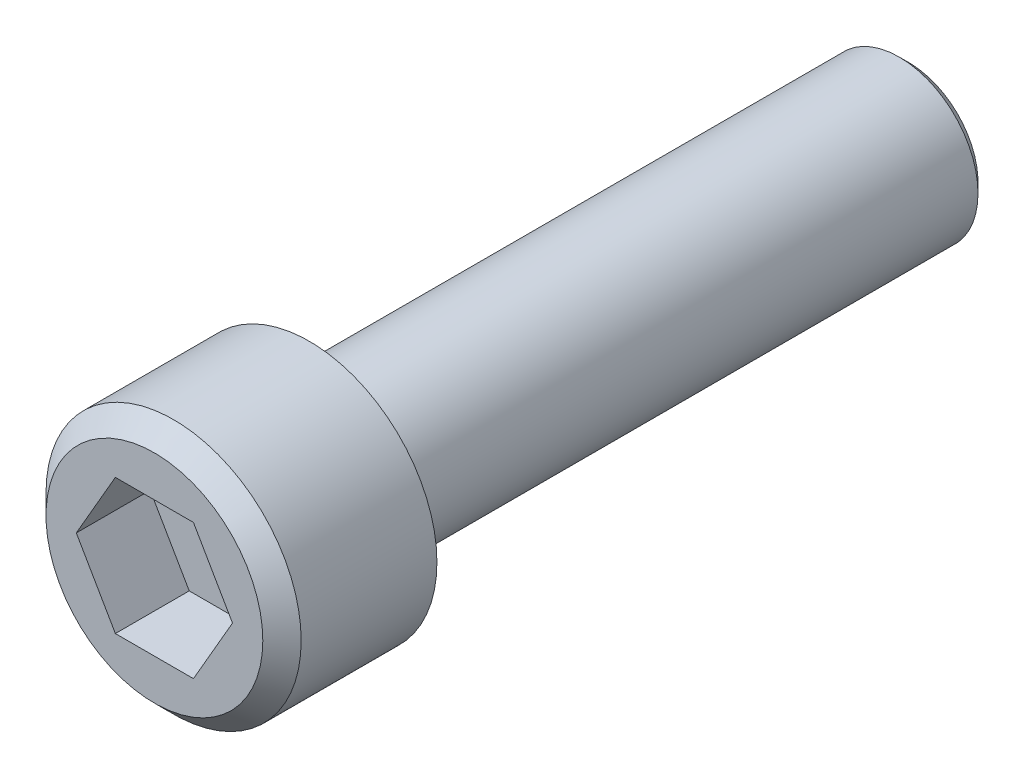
from build123d import *

# Parameters (mm, degrees)
SKETCH1_R           = 3.3782
HEAD_DEPTH          = 4.1021
SKETCH2_R           = 2.0828
SHANK_DEPTH         = 15.875
SOCKET_DEPTH        = 1.9558
BOTTOM_CHAMFER_SIZE = 0.254
TOP_CHAMFER_SIZE    = 0.508


with BuildPart() as part:
    # Sketch1 → Head (new body)
    with BuildSketch(Plane.XY):
        Circle(SKETCH1_R)
    extrude(amount=-HEAD_DEPTH)

    # Sketch2 → Shank (add)
    with BuildSketch(Plane(origin=(0, 0, -4.1021), x_dir=(-1, 0, 0), z_dir=(0, 0, -1))):
        with Locations(Location((0, 0, 0), (0, 0, 180))):
            Circle(SKETCH2_R)
    extrude(amount=SHANK_DEPTH)

    # Sketch3 → Socket (cut)
    with BuildSketch(Plane.XY):
        Polygon((2.067722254, 0), (1.033861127, 1.7907), (-1.033861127, 1.7907), (-2.067722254, 0), (-1.033861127, -1.7907), (1.033861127, -1.7907), align=None)
    extrude(amount=-SOCKET_DEPTH, mode=Mode.SUBTRACT)

    # Bottom Chamfer
    bottom_chamfer_edges = [part.edges().sort_by_distance(p)[0] for p in [
        (-2.0828, 0, -19.9771),
    ]]
    chamfer(bottom_chamfer_edges, length=BOTTOM_CHAMFER_SIZE)

    # Top Chamfer
    top_chamfer_edges = [part.edges().sort_by_distance(p)[0] for p in [
        (-3.3782, 0, 0),
    ]]
    chamfer(top_chamfer_edges, length=TOP_CHAMFER_SIZE)


solid = part.part
